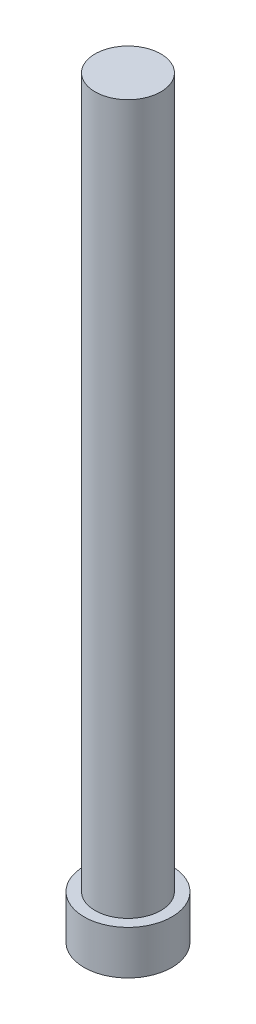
ISO-10303-21;
HEADER;
FILE_DESCRIPTION(('STEP AP214'),'2;1');
FILE_NAME('part.step','',(''),(''),'','','');
FILE_SCHEMA(('AUTOMOTIVE_DESIGN { 1 0 10303 214 1 1 1 1 }'));
ENDSEC;
DATA;
#1=APPLICATION_CONTEXT('core data for automotive mechanical design processes');
#2=APPLICATION_PROTOCOL_DEFINITION('international standard','automotive_design',2000,#1);
#3=PRODUCT_CONTEXT('',#1,'mechanical');
#4=PRODUCT('Part','Part','',(#3));
#5=PRODUCT_RELATED_PRODUCT_CATEGORY('part','',(#4));
#6=PRODUCT_DEFINITION_FORMATION('','',#4);
#7=PRODUCT_DEFINITION_CONTEXT('part definition',#1,'design');
#8=PRODUCT_DEFINITION('design','',#6,#7);
#9=PRODUCT_DEFINITION_SHAPE('','',#8);
#10=(LENGTH_UNIT() NAMED_UNIT(*) SI_UNIT(.MILLI.,.METRE.));
#11=(NAMED_UNIT(*) PLANE_ANGLE_UNIT() SI_UNIT($,.RADIAN.));
#12=(NAMED_UNIT(*) SI_UNIT($,.STERADIAN.) SOLID_ANGLE_UNIT());
#13=UNCERTAINTY_MEASURE_WITH_UNIT(LENGTH_MEASURE(1.E-05),#10,'distance_accuracy_value','');
#14=(GEOMETRIC_REPRESENTATION_CONTEXT(3) GLOBAL_UNCERTAINTY_ASSIGNED_CONTEXT((#13)) GLOBAL_UNIT_ASSIGNED_CONTEXT((#10,
#11,#12)) REPRESENTATION_CONTEXT('',''));
#15=CARTESIAN_POINT('',(0.,0.,0.));
#16=DIRECTION('',(0.,0.,1.));
#17=DIRECTION('',(1.,0.,0.));
#18=AXIS2_PLACEMENT_3D('',#15,#16,#17);
#19=CARTESIAN_POINT('',(0.,0.,0.));
#20=DIRECTION('',(0.,-1.,0.));
#21=DIRECTION('',(0.,0.,-1.));
#22=AXIS2_PLACEMENT_3D('',#19,#20,#21);
#23=PLANE('',#22);
#24=CARTESIAN_POINT('',(0.,0.,0.));
#25=DIRECTION('',(0.,1.,0.));
#26=DIRECTION('',(0.,0.,1.));
#27=AXIS2_PLACEMENT_3D('',#24,#25,#26);
#28=CIRCLE('',#27,5.99999999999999);
#29=CARTESIAN_POINT('',(0.,0.,5.99999999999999));
#30=VERTEX_POINT('',#29);
#31=EDGE_CURVE('E10',#30,#30,#28,.T.);
#32=ORIENTED_EDGE('',*,*,#31,.F.);
#33=EDGE_LOOP('',(#32));
#34=FACE_BOUND('',#33,.T.);
#35=ADVANCED_FACE('F31',(#34),#23,.T.);
#36=CARTESIAN_POINT('',(0.,49.4323076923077,0.));
#37=DIRECTION('',(0.,1.,0.));
#38=DIRECTION('',(0.,0.,1.));
#39=AXIS2_PLACEMENT_3D('',#36,#37,#38);
#40=CYLINDRICAL_SURFACE('',#39,5.99999999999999);
#41=ORIENTED_EDGE('',*,*,#31,.T.);
#42=EDGE_LOOP('',(#41));
#43=FACE_BOUND('',#42,.T.);
#44=CARTESIAN_POINT('',(0.,6.,0.));
#45=DIRECTION('',(0.,1.,0.));
#46=DIRECTION('',(0.,0.,1.));
#47=AXIS2_PLACEMENT_3D('',#44,#45,#46);
#48=CIRCLE('',#47,5.99999999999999);
#49=CARTESIAN_POINT('',(0.,6.,5.99999999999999));
#50=VERTEX_POINT('',#49);
#51=EDGE_CURVE('E37',#50,#50,#48,.T.);
#52=ORIENTED_EDGE('',*,*,#51,.F.);
#53=EDGE_LOOP('',(#52));
#54=FACE_BOUND('',#53,.T.);
#55=ADVANCED_FACE('F63',(#43,#54),#40,.T.);
#56=CARTESIAN_POINT('',(-5.99999999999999,6.,0.));
#57=DIRECTION('',(0.,1.,0.));
#58=DIRECTION('',(0.,0.,1.));
#59=AXIS2_PLACEMENT_3D('',#56,#57,#58);
#60=PLANE('',#59);
#61=ORIENTED_EDGE('',*,*,#51,.T.);
#62=EDGE_LOOP('',(#61));
#63=FACE_BOUND('',#62,.T.);
#64=CARTESIAN_POINT('',(0.,6.,0.));
#65=DIRECTION('',(0.,1.,0.));
#66=DIRECTION('',(0.,0.,1.));
#67=AXIS2_PLACEMENT_3D('',#64,#65,#66);
#68=CIRCLE('',#67,4.49999999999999);
#69=CARTESIAN_POINT('',(0.,6.,4.49999999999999));
#70=VERTEX_POINT('',#69);
#71=EDGE_CURVE('E41',#70,#70,#68,.T.);
#72=ORIENTED_EDGE('',*,*,#71,.F.);
#73=EDGE_LOOP('',(#72));
#74=FACE_BOUND('',#73,.T.);
#75=ADVANCED_FACE('F55',(#63,#74),#60,.T.);
#76=CARTESIAN_POINT('',(0.,49.4323076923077,0.));
#77=DIRECTION('',(0.,1.,0.));
#78=DIRECTION('',(0.,0.,1.));
#79=AXIS2_PLACEMENT_3D('',#76,#77,#78);
#80=CYLINDRICAL_SURFACE('',#79,4.49999999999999);
#81=ORIENTED_EDGE('',*,*,#71,.T.);
#82=EDGE_LOOP('',(#81));
#83=FACE_BOUND('',#82,.T.);
#84=CARTESIAN_POINT('',(0.,103.,0.));
#85=DIRECTION('',(0.,1.,0.));
#86=DIRECTION('',(0.,0.,1.));
#87=AXIS2_PLACEMENT_3D('',#84,#85,#86);
#88=CIRCLE('',#87,4.49999999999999);
#89=CARTESIAN_POINT('',(0.,103.,4.49999999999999));
#90=VERTEX_POINT('',#89);
#91=EDGE_CURVE('E45',#90,#90,#88,.T.);
#92=ORIENTED_EDGE('',*,*,#91,.F.);
#93=EDGE_LOOP('',(#92));
#94=FACE_BOUND('',#93,.T.);
#95=ADVANCED_FACE('F53',(#83,#94),#80,.T.);
#96=CARTESIAN_POINT('',(-4.49999999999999,103.,0.));
#97=DIRECTION('',(0.,1.,0.));
#98=DIRECTION('',(0.,0.,1.));
#99=AXIS2_PLACEMENT_3D('',#96,#97,#98);
#100=PLANE('',#99);
#101=ORIENTED_EDGE('',*,*,#91,.T.);
#102=EDGE_LOOP('',(#101));
#103=FACE_BOUND('',#102,.T.);
#104=ADVANCED_FACE('F51',(#103),#100,.T.);
#105=CLOSED_SHELL('',(#35,#55,#75,#95,#104));
#106=MANIFOLD_SOLID_BREP('B2',#105);
#107=ADVANCED_BREP_SHAPE_REPRESENTATION('',(#18,#106),#14);
#108=SHAPE_DEFINITION_REPRESENTATION(#9,#107);
ENDSEC;
END-ISO-10303-21;
